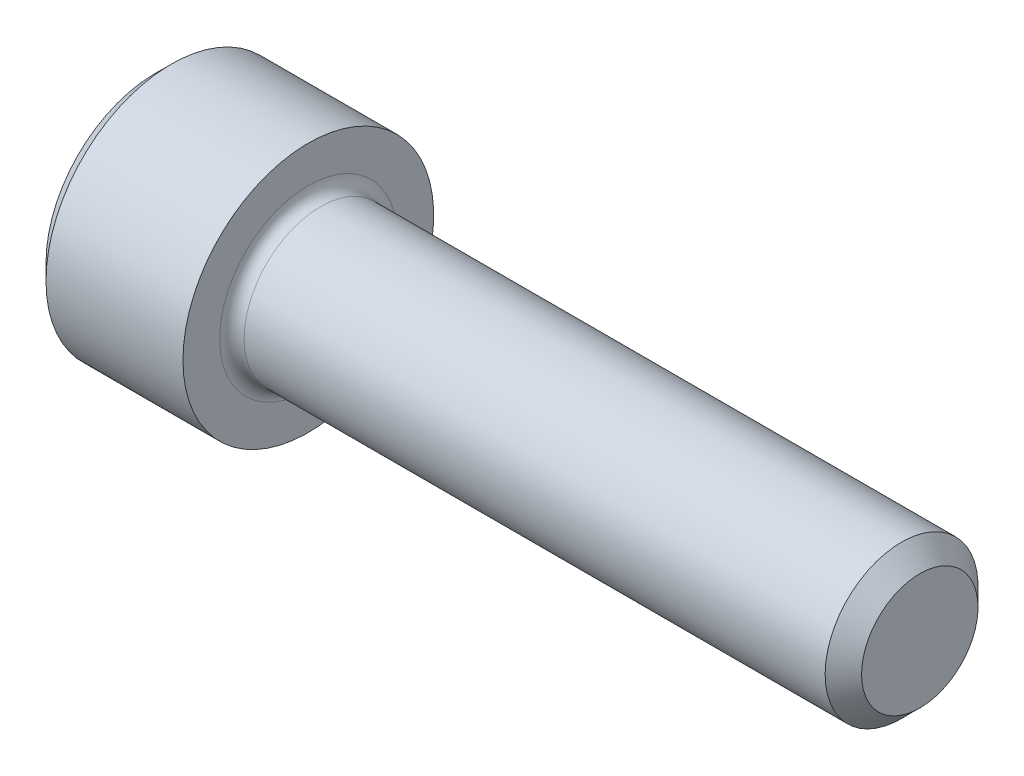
from build123d import *

# Parameters (mm, degrees)
FILLET1_R   = 0.254
HEX_2_DEPTH = 1.4478


with BuildPart() as part:
    # BodySke → Base-Revolve (revolve)
    with BuildSketch(Plane.XY, mode=Mode.PRIVATE) as base_revolve_sk:
        Polygon((0, 0), (0, 2.2733), (0.3302, 2.6035), (3.175, 2.6035), (3.175, 1.5875), (15.49654, 1.5875), (15.875, 1.20904), (15.875, 0), align=None)
    revolve(base_revolve_sk.sketch.rotate(Axis((-31.75, 0, 0), (1, 0, 0)), 90), axis=Axis((-31.75, 0, 0), (1, 0, 0)))

    # Fillet1
    fillet1_edges = [part.edges().sort_by_distance(p)[0] for p in [
        (3.175, 0, -1.5875),
    ]]
    fillet(fillet1_edges, radius=FILLET1_R)

    # Sketch2 → Hex-PreBroach (revolve, cut)
    with BuildSketch(Plane.XY, mode=Mode.PRIVATE) as hex_prebroach_sk:
        Polygon((0, 1.1938), (1.4478, 1.1938), (2.137040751, 0), (0, 0), align=None)
    revolve(hex_prebroach_sk.sketch.rotate(Axis((0, 0, 0), (1, 0, 0)), 90), axis=Axis((0, 0, 0), (1, 0, 0)), mode=Mode.SUBTRACT)

    # Sketch3 → Hex 2 (cut)
    with BuildSketch(Plane(origin=(0, 0, 0), x_dir=(0, 0.500000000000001, 0.866025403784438), z_dir=(-1, 0, 0))):
        Polygon((0.689240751, 1.1938), (-0.689240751, 1.1938), (-1.378481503, 0), (-0.689240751, -1.1938), (0.689240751, -1.1938), (1.378481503, 0), align=None)
    extrude(amount=-HEX_2_DEPTH, mode=Mode.SUBTRACT)


solid = part.part
